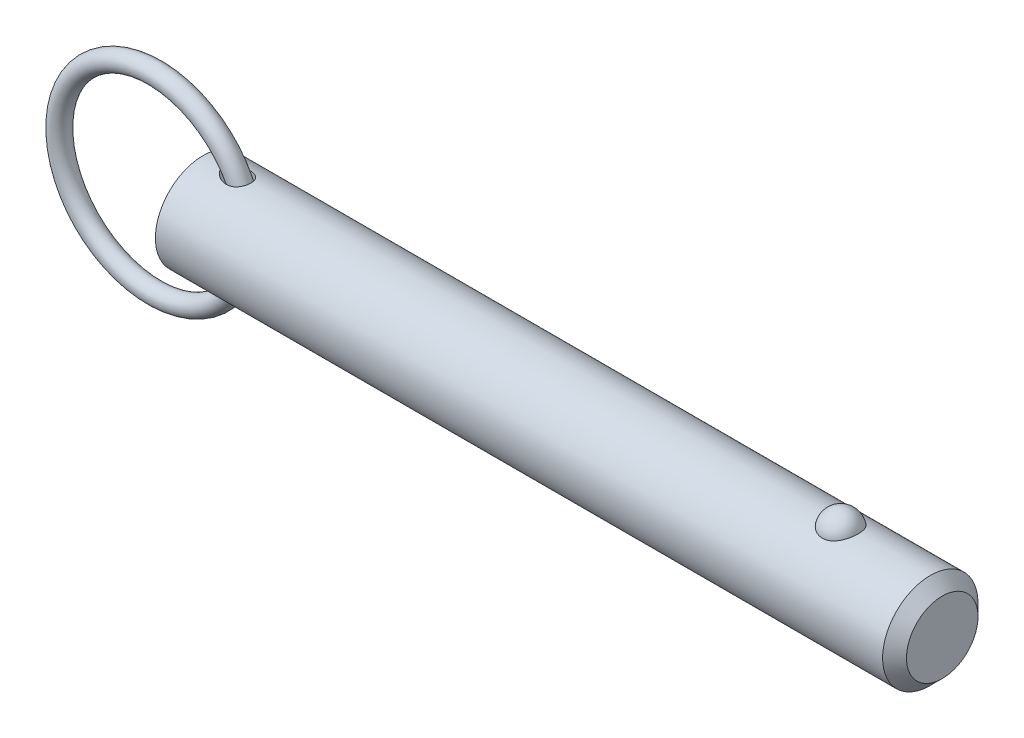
ISO-10303-21;
HEADER;
FILE_DESCRIPTION(('STEP AP214'),'2;1');
FILE_NAME('part.step','',(''),(''),'','','');
FILE_SCHEMA(('AUTOMOTIVE_DESIGN { 1 0 10303 214 1 1 1 1 }'));
ENDSEC;
DATA;
#1=APPLICATION_CONTEXT('core data for automotive mechanical design processes');
#2=APPLICATION_PROTOCOL_DEFINITION('international standard','automotive_design',2000,#1);
#3=PRODUCT_CONTEXT('',#1,'mechanical');
#4=PRODUCT('Part','Part','',(#3));
#5=PRODUCT_RELATED_PRODUCT_CATEGORY('part','',(#4));
#6=PRODUCT_DEFINITION_FORMATION('','',#4);
#7=PRODUCT_DEFINITION_CONTEXT('part definition',#1,'design');
#8=PRODUCT_DEFINITION('design','',#6,#7);
#9=PRODUCT_DEFINITION_SHAPE('','',#8);
#10=(LENGTH_UNIT() NAMED_UNIT(*) SI_UNIT(.MILLI.,.METRE.));
#11=(NAMED_UNIT(*) PLANE_ANGLE_UNIT() SI_UNIT($,.RADIAN.));
#12=(NAMED_UNIT(*) SI_UNIT($,.STERADIAN.) SOLID_ANGLE_UNIT());
#13=UNCERTAINTY_MEASURE_WITH_UNIT(LENGTH_MEASURE(1.E-05),#10,'distance_accuracy_value','');
#14=(GEOMETRIC_REPRESENTATION_CONTEXT(3) GLOBAL_UNCERTAINTY_ASSIGNED_CONTEXT((#13)) GLOBAL_UNIT_ASSIGNED_CONTEXT((#10,
#11,#12)) REPRESENTATION_CONTEXT('',''));
#15=CARTESIAN_POINT('',(0.,0.,0.));
#16=DIRECTION('',(0.,0.,1.));
#17=DIRECTION('',(1.,0.,0.));
#18=AXIS2_PLACEMENT_3D('',#15,#16,#17);
#19=CARTESIAN_POINT('',(-9.66825126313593,0.,0.));
#20=DIRECTION('',(0.,0.,1.));
#21=DIRECTION('',(1.,0.,0.));
#22=AXIS2_PLACEMENT_3D('',#19,#20,#21);
#23=TOROIDAL_SURFACE('',#22,19.05,1.905);
#24=CARTESIAN_POINT('',(11.2867487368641,0.,0.));
#25=VERTEX_POINT('',#24);
#26=VERTEX_LOOP('',#25);
#27=FACE_BOUND('',#26,.T.);
#28=ADVANCED_FACE('P0_F12',(#27),#23,.T.);
#29=CLOSED_SHELL('',(#28));
#30=MANIFOLD_SOLID_BREP('P0_B1',#29);
#31=CARTESIAN_POINT('',(0.,0.,0.));
#32=DIRECTION('',(1.,0.,0.));
#33=DIRECTION('',(0.,0.,-1.));
#34=AXIS2_PLACEMENT_3D('',#31,#32,#33);
#35=CYLINDRICAL_SURFACE('',#34,9.525);
#36=CARTESIAN_POINT('',(4.56693409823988,9.43141941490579,-1.33189820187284));
#37=CARTESIAN_POINT('',(4.70260475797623,9.41020313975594,-1.48215931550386));
#38=CARTESIAN_POINT('',(4.85555680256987,9.38755003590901,-1.61683982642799));
#39=CARTESIAN_POINT('',(5.10171959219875,9.35450554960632,-1.79512943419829));
#40=CARTESIAN_POINT('',(5.18674514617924,9.34362629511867,-1.85068909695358));
#41=CARTESIAN_POINT('',(5.36154389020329,9.32258514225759,-1.95392002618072));
#42=CARTESIAN_POINT('',(5.45131542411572,9.31242299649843,-2.00159402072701));
#43=CARTESIAN_POINT('',(5.70070211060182,9.28632120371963,-2.12033289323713));
#44=CARTESIAN_POINT('',(5.86420408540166,9.27146938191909,-2.18362944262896));
#45=CARTESIAN_POINT('',(6.19893345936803,9.24694163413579,-2.28525783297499));
#46=CARTESIAN_POINT('',(6.37015384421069,9.23726110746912,-2.32361187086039));
#47=CARTESIAN_POINT('',(6.73531776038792,9.22400982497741,-2.37575048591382));
#48=CARTESIAN_POINT('',(6.92975826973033,9.22118808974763,-2.38652934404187));
#49=CARTESIAN_POINT('',(7.21995443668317,9.22416297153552,-2.37494980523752));
#50=CARTESIAN_POINT('',(7.31643847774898,9.22635560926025,-2.366466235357));
#51=CARTESIAN_POINT('',(7.50796421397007,9.2331428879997,-2.33985028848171));
#52=CARTESIAN_POINT('',(7.60300650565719,9.23773650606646,-2.32172202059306));
#53=CARTESIAN_POINT('',(7.83273114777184,9.25183311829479,-2.26504721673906));
#54=CARTESIAN_POINT('',(7.96603028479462,9.26261470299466,-2.2209856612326));
#55=CARTESIAN_POINT('',(8.22310899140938,9.28816519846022,-2.11157306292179));
#56=CARTESIAN_POINT('',(8.34689477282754,9.30293147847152,-2.04623606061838));
#57=CARTESIAN_POINT('',(8.58136049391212,9.3349416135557,-1.89485344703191));
#58=CARTESIAN_POINT('',(8.69199721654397,9.35219324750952,-1.80874222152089));
#59=CARTESIAN_POINT('',(8.89592093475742,9.38707016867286,-1.61799188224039));
#60=CARTESIAN_POINT('',(8.98920771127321,9.40469546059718,-1.51335253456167));
#61=CARTESIAN_POINT('',(9.15057731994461,9.43713590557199,-1.29519427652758));
#62=CARTESIAN_POINT('',(9.21980158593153,9.45205440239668,-1.18253282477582));
#63=CARTESIAN_POINT('',(9.33826736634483,9.47856708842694,-0.946802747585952));
#64=CARTESIAN_POINT('',(9.38751161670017,9.49016173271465,-0.823735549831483));
#65=CARTESIAN_POINT('',(9.46423850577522,9.50859378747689,-0.572614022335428));
#66=CARTESIAN_POINT('',(9.49202393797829,9.5154972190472,-0.444656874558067));
#67=CARTESIAN_POINT('',(9.52636926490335,9.52406905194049,-0.185752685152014));
#68=CARTESIAN_POINT('',(9.53292923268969,9.52573747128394,-0.0548056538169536));
#69=CARTESIAN_POINT('',(9.52467276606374,9.52365852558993,0.206503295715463));
#70=CARTESIAN_POINT('',(9.50983454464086,9.51990564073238,0.336864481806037));
#71=CARTESIAN_POINT('',(9.45907362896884,9.50737852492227,0.59316631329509));
#72=CARTESIAN_POINT('',(9.42315106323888,9.49860432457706,0.71910698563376));
#73=CARTESIAN_POINT('',(9.33106648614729,9.47698928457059,0.96295935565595));
#74=CARTESIAN_POINT('',(9.27490839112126,9.46414923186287,1.08087260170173));
#75=CARTESIAN_POINT('',(9.14375803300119,9.43581000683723,1.30534632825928));
#76=CARTESIAN_POINT('',(9.06876720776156,9.42031103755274,1.41190767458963));
#77=CARTESIAN_POINT('',(8.90203187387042,9.38836719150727,1.61069439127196));
#78=CARTESIAN_POINT('',(8.81029913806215,9.37192298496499,1.70292975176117));
#79=CARTESIAN_POINT('',(8.61268775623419,9.33985045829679,1.87086859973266));
#80=CARTESIAN_POINT('',(8.50680947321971,9.3242221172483,1.94657251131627));
#81=CARTESIAN_POINT('',(8.28220546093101,9.29513431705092,2.08109032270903));
#82=CARTESIAN_POINT('',(8.16329919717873,9.28171415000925,2.1396103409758));
#83=CARTESIAN_POINT('',(7.91756052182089,9.25859072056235,2.23755716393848));
#84=CARTESIAN_POINT('',(7.79072606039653,9.24888842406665,2.27697900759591));
#85=CARTESIAN_POINT('',(7.52377913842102,9.23338749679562,2.33907806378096));
#86=CARTESIAN_POINT('',(7.38334767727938,9.22789571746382,2.36044900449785));
#87=CARTESIAN_POINT('',(7.10081394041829,9.22210229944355,2.3829751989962));
#88=CARTESIAN_POINT('',(6.95871103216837,9.22180269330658,2.38412253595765));
#89=CARTESIAN_POINT('',(6.65642691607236,9.22632724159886,2.36656230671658));
#90=CARTESIAN_POINT('',(6.49641694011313,9.23185415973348,2.3451317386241));
#91=CARTESIAN_POINT('',(6.18115433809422,9.24811737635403,2.28014143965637));
#92=CARTESIAN_POINT('',(6.02590710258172,9.25885936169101,2.23655754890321));
#93=CARTESIAN_POINT('',(5.6990472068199,9.28624254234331,2.12025087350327));
#94=CARTESIAN_POINT('',(5.52873601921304,9.30354853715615,2.04400672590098));
#95=CARTESIAN_POINT('',(5.20289495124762,9.34106989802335,1.86504730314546));
#96=CARTESIAN_POINT('',(5.04735968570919,9.36128419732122,1.76234172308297));
#97=CARTESIAN_POINT('',(4.79287124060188,9.39697639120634,1.55895334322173));
#98=CARTESIAN_POINT('',(4.68938704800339,9.41240250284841,1.46392900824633));
#99=CARTESIAN_POINT('',(4.49847141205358,9.44202586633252,1.25875918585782));
#100=CARTESIAN_POINT('',(4.41101129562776,9.45622528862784,1.1486413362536));
#101=CARTESIAN_POINT('',(4.27502257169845,9.47888210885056,0.940600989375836));
#102=CARTESIAN_POINT('',(4.22216329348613,9.48791121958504,0.845586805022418));
#103=CARTESIAN_POINT('',(4.13241478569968,9.50344321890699,0.648051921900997));
#104=CARTESIAN_POINT('',(4.09551182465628,9.50994827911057,0.545537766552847));
#105=CARTESIAN_POINT('',(4.04043124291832,9.51971586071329,0.334452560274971));
#106=CARTESIAN_POINT('',(4.02240728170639,9.52295176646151,0.225839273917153));
#107=CARTESIAN_POINT('',(4.00750873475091,9.52562364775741,0.00713006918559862));
#108=CARTESIAN_POINT('',(4.01062334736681,9.52506156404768,-0.10296506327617));
#109=CARTESIAN_POINT('',(4.03592967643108,9.52053221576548,-0.306944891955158));
#110=CARTESIAN_POINT('',(4.05571676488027,9.51699426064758,-0.401151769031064));
#111=CARTESIAN_POINT('',(4.10967975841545,9.5074546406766,-0.585176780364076));
#112=CARTESIAN_POINT('',(4.14385995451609,9.50145224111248,-0.674993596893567));
#113=CARTESIAN_POINT('',(4.23261356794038,9.48611703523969,-0.866116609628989));
#114=CARTESIAN_POINT('',(4.28990016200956,9.47635800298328,-0.96612166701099));
#115=CARTESIAN_POINT('',(4.41856577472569,9.45502867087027,-1.15640011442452));
#116=CARTESIAN_POINT('',(4.48996918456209,9.44345524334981,-1.24665623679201));
#117=CARTESIAN_POINT('',(4.56693409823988,9.43141941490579,-1.33189820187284));
#118=B_SPLINE_CURVE_WITH_KNOTS('',3,(#36,#37,#38,#39,#40,#41,#42,#43,#44,#45,#46,#47,#48,#49,
#50,#51,#52,#53,#54,#55,#56,#57,#58,#59,#60,#61,#62,#63,#64,#65,#66,#67,#68,#69,#70,#71,#72,#73,
#74,#75,#76,#77,#78,#79,#80,#81,#82,#83,#84,#85,#86,#87,#88,#89,#90,#91,#92,#93,#94,#95,#96,#97,
#98,#99,#100,#101,#102,#103,#104,#105,#106,#107,#108,#109,#110,#111,#112,#113,#114,#115,#116,
#117),.UNSPECIFIED.,.T.,.F.,(4,2,2,2,2,2,2,2,2,2,2,2,2,2,2,2,2,2,2,2,2,2,2,2,2,2,2,2,2,2,2,2,2,
2,2,2,2,2,2,2,4),(0.,0.609951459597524,0.916123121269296,1.22218863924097,1.74791337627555,
2.27316961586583,2.85362722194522,3.14383229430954,3.43391382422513,3.85437497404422,
4.27455920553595,4.69608835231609,5.11762282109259,5.5149005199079,5.91212379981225,
6.30363414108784,6.69514313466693,7.08705103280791,7.47895654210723,7.87078624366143,
8.26258603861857,8.65411137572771,9.04562666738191,9.44349251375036,9.84146165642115,
10.2662286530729,10.6911619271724,11.1739180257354,11.6572017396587,12.2170157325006,
12.776624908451,13.1992556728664,13.6211226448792,13.9471990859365,14.2729943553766,
14.6014211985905,14.9296802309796,15.2173810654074,15.505167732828,15.8505863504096,
16.1966070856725),.UNSPECIFIED.);
#119=CARTESIAN_POINT('',(4.56693409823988,9.43141941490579,-1.33189820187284));
#120=VERTEX_POINT('',#119);
#121=EDGE_CURVE('P1_E40',#120,#120,#118,.T.);
#122=ORIENTED_EDGE('',*,*,#121,.T.);
#123=EDGE_LOOP('',(#122));
#124=FACE_BOUND('',#123,.T.);
#125=CARTESIAN_POINT('',(145.24875,0.,0.));
#126=DIRECTION('',(1.,0.,0.));
#127=DIRECTION('',(0.,0.,-1.));
#128=AXIS2_PLACEMENT_3D('',#125,#126,#127);
#129=CIRCLE('',#128,9.525);
#130=CARTESIAN_POINT('',(145.24875,0.,-9.525));
#131=VERTEX_POINT('',#130);
#132=EDGE_CURVE('P1_E25',#131,#131,#129,.T.);
#133=ORIENTED_EDGE('',*,*,#132,.F.);
#134=EDGE_LOOP('',(#133));
#135=FACE_BOUND('',#134,.T.);
#136=CARTESIAN_POINT('',(0.,0.,0.));
#137=DIRECTION('',(1.,0.,0.));
#138=DIRECTION('',(0.,0.,-1.));
#139=AXIS2_PLACEMENT_3D('',#136,#137,#138);
#140=CIRCLE('',#139,9.525);
#141=CARTESIAN_POINT('',(0.,0.,-9.525));
#142=VERTEX_POINT('',#141);
#143=EDGE_CURVE('P1_E9',#142,#142,#140,.T.);
#144=ORIENTED_EDGE('',*,*,#143,.T.);
#145=EDGE_LOOP('',(#144));
#146=FACE_BOUND('',#145,.T.);
#147=CARTESIAN_POINT('',(127.345757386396,8.80405803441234,3.63513233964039));
#148=CARTESIAN_POINT('',(127.251676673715,8.80405953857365,3.63513053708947));
#149=CARTESIAN_POINT('',(127.157561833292,8.80561325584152,3.63137461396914));
#150=CARTESIAN_POINT('',(126.970012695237,8.81177748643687,3.61638665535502));
#151=CARTESIAN_POINT('',(126.876578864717,8.81638992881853,3.60514990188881));
#152=CARTESIAN_POINT('',(126.597945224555,8.83467114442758,3.56024627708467));
#153=CARTESIAN_POINT('',(126.414691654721,8.85278327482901,3.51538626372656));
#154=CARTESIAN_POINT('',(126.059509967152,8.89871214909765,3.39742145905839));
#155=CARTESIAN_POINT('',(125.887553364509,8.92650327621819,3.32439116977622));
#156=CARTESIAN_POINT('',(125.558707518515,8.98874819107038,3.15220244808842));
#157=CARTESIAN_POINT('',(125.401811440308,9.02319893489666,3.053055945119));
#158=CARTESIAN_POINT('',(125.102214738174,9.0962918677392,2.82797815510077));
#159=CARTESIAN_POINT('',(124.960060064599,9.13502685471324,2.70135138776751));
#160=CARTESIAN_POINT('',(124.698299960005,9.21186572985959,2.42641932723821));
#161=CARTESIAN_POINT('',(124.578701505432,9.2499694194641,2.27810735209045));
#162=CARTESIAN_POINT('',(124.359645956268,9.3234108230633,1.95652290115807));
#163=CARTESIAN_POINT('',(124.261317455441,9.35855090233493,1.78243511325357));
#164=CARTESIAN_POINT('',(124.093819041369,9.42045142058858,1.41937246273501));
#165=CARTESIAN_POINT('',(124.024651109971,9.44721128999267,1.23039658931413));
#166=CARTESIAN_POINT('',(123.916199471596,9.48990641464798,0.840370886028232));
#167=CARTESIAN_POINT('',(123.877288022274,9.50570658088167,0.639202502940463));
#168=CARTESIAN_POINT('',(123.831555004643,9.52433146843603,0.232664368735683));
#169=CARTESIAN_POINT('',(123.824732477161,9.52715657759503,0.0272947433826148));
#170=CARTESIAN_POINT('',(123.843255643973,9.51956918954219,-0.380478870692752));
#171=CARTESIAN_POINT('',(123.868405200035,9.50923740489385,-0.582893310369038));
#172=CARTESIAN_POINT('',(123.95002537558,9.47651897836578,-0.980293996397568));
#173=CARTESIAN_POINT('',(124.006496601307,9.45413210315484,-1.17528009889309));
#174=CARTESIAN_POINT('',(124.149719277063,9.39954044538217,-1.55263697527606));
#175=CARTESIAN_POINT('',(124.236512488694,9.36732213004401,-1.73498993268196));
#176=CARTESIAN_POINT('',(124.438610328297,9.29640700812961,-2.08177763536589));
#177=CARTESIAN_POINT('',(124.553917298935,9.25770966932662,-2.24621090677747));
#178=CARTESIAN_POINT('',(124.811264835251,9.17775604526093,-2.55338333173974));
#179=CARTESIAN_POINT('',(124.953434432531,9.13648808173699,-2.69601150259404));
#180=CARTESIAN_POINT('',(125.26089985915,9.05620497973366,-2.95451229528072));
#181=CARTESIAN_POINT('',(125.426193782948,9.01718965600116,-3.07038711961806));
#182=CARTESIAN_POINT('',(125.772052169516,8.94680019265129,-3.26976836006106));
#183=CARTESIAN_POINT('',(125.952227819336,8.91528408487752,-3.35389750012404));
#184=CARTESIAN_POINT('',(126.325651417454,8.86272514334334,-3.49043503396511));
#185=CARTESIAN_POINT('',(126.518894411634,8.84167836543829,-3.54285537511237));
#186=CARTESIAN_POINT('',(126.902503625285,8.81348056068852,-3.612413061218));
#187=CARTESIAN_POINT('',(127.092525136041,8.80568348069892,-3.63119339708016));
#188=CARTESIAN_POINT('',(127.473190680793,8.80289410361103,-3.63795342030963));
#189=CARTESIAN_POINT('',(127.663834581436,8.80789922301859,-3.62593932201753));
#190=CARTESIAN_POINT('',(128.034007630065,8.82974915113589,-3.57238430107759));
#191=CARTESIAN_POINT('',(128.213697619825,8.84621463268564,-3.53178890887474));
#192=CARTESIAN_POINT('',(128.563422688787,8.88875330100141,-3.42331083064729));
#193=CARTESIAN_POINT('',(128.733456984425,8.91482726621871,-3.35542593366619));
#194=CARTESIAN_POINT('',(129.063237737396,8.974482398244,-3.1924822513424));
#195=CARTESIAN_POINT('',(129.222680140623,9.00821446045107,-3.09686474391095));
#196=CARTESIAN_POINT('',(129.523513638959,9.0793539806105,-2.88162736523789));
#197=CARTESIAN_POINT('',(129.664900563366,9.1167622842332,-2.76200196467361));
#198=CARTESIAN_POINT('',(129.93331931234,9.19347419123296,-2.4951628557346));
#199=CARTESIAN_POINT('',(130.059275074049,9.23277872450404,-2.34686614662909));
#200=CARTESIAN_POINT('',(130.285522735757,9.30737610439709,-2.03093683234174));
#201=CARTESIAN_POINT('',(130.38581004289,9.34266823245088,-1.86330077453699));
#202=CARTESIAN_POINT('',(130.561514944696,9.40674710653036,-1.50744893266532));
#203=CARTESIAN_POINT('',(130.636041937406,9.4352917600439,-1.31874876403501));
#204=CARTESIAN_POINT('',(130.75416505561,9.48144132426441,-0.93063102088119));
#205=CARTESIAN_POINT('',(130.797760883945,9.49904612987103,-0.731213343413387));
#206=CARTESIAN_POINT('',(130.853158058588,9.5215314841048,-0.327147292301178));
#207=CARTESIAN_POINT('',(130.864935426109,9.52640243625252,-0.122495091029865));
#208=CARTESIAN_POINT('',(130.856382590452,9.52289571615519,0.286018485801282));
#209=CARTESIAN_POINT('',(130.83605305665,9.51451832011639,0.489879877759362));
#210=CARTESIAN_POINT('',(130.763884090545,9.48544083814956,0.889994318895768));
#211=CARTESIAN_POINT('',(130.712199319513,9.46480124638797,1.08627971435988));
#212=CARTESIAN_POINT('',(130.578491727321,9.41333895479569,1.4668208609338));
#213=CARTESIAN_POINT('',(130.496466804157,9.38251554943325,1.6510757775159));
#214=CARTESIAN_POINT('',(130.30319292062,9.31365636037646,2.00346348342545));
#215=CARTESIAN_POINT('',(130.191783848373,9.27558138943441,2.17150083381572));
#216=CARTESIAN_POINT('',(129.942294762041,9.19638714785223,2.48563115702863));
#217=CARTESIAN_POINT('',(129.804216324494,9.1552680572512,2.63172542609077));
#218=CARTESIAN_POINT('',(129.504843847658,9.07465393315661,2.89750997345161));
#219=CARTESIAN_POINT('',(129.343610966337,9.03515496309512,3.01726776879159));
#220=CARTESIAN_POINT('',(129.001613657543,8.96227564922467,3.22732920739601));
#221=CARTESIAN_POINT('',(128.820841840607,8.92889763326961,3.3176216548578));
#222=CARTESIAN_POINT('',(128.451445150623,8.87345380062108,3.4631441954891));
#223=CARTESIAN_POINT('',(128.26332371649,8.8510298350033,3.51950082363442));
#224=CARTESIAN_POINT('',(127.97578699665,8.82666967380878,3.57993683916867));
#225=CARTESIAN_POINT('',(127.879133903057,8.82009725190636,3.59606217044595));
#226=CARTESIAN_POINT('',(127.684677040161,8.81020897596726,3.62022512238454));
#227=CARTESIAN_POINT('',(127.58687410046,8.80689090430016,3.62826825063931));
#228=CARTESIAN_POINT('',(127.441224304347,8.80445615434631,3.63416760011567));
#229=CARTESIAN_POINT('',(127.393495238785,8.80405727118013,3.63513325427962));
#230=CARTESIAN_POINT('',(127.345757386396,8.80405803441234,3.63513233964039));
#231=B_SPLINE_CURVE_WITH_KNOTS('',3,(#147,#148,#149,#150,#151,#152,#153,#154,#155,#156,#157,
#158,#159,#160,#161,#162,#163,#164,#165,#166,#167,#168,#169,#170,#171,#172,#173,#174,#175,#176,
#177,#178,#179,#180,#181,#182,#183,#184,#185,#186,#187,#188,#189,#190,#191,#192,#193,#194,#195,
#196,#197,#198,#199,#200,#201,#202,#203,#204,#205,#206,#207,#208,#209,#210,#211,#212,#213,#214,
#215,#216,#217,#218,#219,#220,#221,#222,#223,#224,#225,#226,#227,#228,#229,#230),.UNSPECIFIED.,
.T.,.F.,(4,2,2,2,2,2,2,2,2,2,2,2,2,2,2,2,2,2,2,2,2,2,2,2,2,2,2,2,2,2,2,2,2,2,2,2,2,2,2,2,2,4),
(0.,0.282202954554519,0.564584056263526,1.13017050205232,1.69427128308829,2.25811483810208,
2.83836627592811,3.41879688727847,4.0249711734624,4.63118665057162,5.24474754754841,
5.85829010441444,6.46808687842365,7.0778954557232,7.68854723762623,8.29924920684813,
8.91296283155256,9.52662591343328,10.127533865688,10.7282152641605,11.2986646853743,
11.8689989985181,12.4213015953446,12.9736489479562,13.5380053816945,14.102491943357,
14.6952986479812,15.288211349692,15.8999469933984,16.5116885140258,17.1238909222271,
17.7360805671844,18.3452748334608,18.954511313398,19.5671386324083,20.1797297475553,
20.7907316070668,21.4019653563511,21.9915938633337,22.2859053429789,22.5800161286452,
22.7232098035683),.UNSPECIFIED.);
#232=CARTESIAN_POINT('',(127.345757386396,8.80405803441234,3.63513233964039));
#233=VERTEX_POINT('',#232);
#234=EDGE_CURVE('P1_E34',#233,#233,#231,.T.);
#235=ORIENTED_EDGE('',*,*,#234,.T.);
#236=EDGE_LOOP('',(#235));
#237=FACE_BOUND('',#236,.T.);
#238=CARTESIAN_POINT('',(4.56693409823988,-9.43141941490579,-1.33189820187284));
#239=CARTESIAN_POINT('',(4.48932984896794,-9.4435553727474,-1.24594548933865));
#240=CARTESIAN_POINT('',(4.41737309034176,-9.45522193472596,-1.1548795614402));
#241=CARTESIAN_POINT('',(4.2878104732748,-9.47670896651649,-0.962782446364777));
#242=CARTESIAN_POINT('',(4.23019403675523,-9.48653079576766,-0.861758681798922));
#243=CARTESIAN_POINT('',(4.13254559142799,-9.5034118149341,-0.649723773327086));
#244=CARTESIAN_POINT('',(4.09271158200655,-9.51043980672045,-0.538615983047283));
#245=CARTESIAN_POINT('',(4.04973167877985,-9.51806966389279,-0.367764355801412));
#246=CARTESIAN_POINT('',(4.03820037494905,-9.52012756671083,-0.310118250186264));
#247=CARTESIAN_POINT('',(4.02100287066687,-9.52320274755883,-0.193935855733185));
#248=CARTESIAN_POINT('',(4.01533565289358,-9.52422020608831,-0.13539972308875));
#249=CARTESIAN_POINT('',(4.00817074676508,-9.52550497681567,0.0247266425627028));
#250=CARTESIAN_POINT('',(4.01270492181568,-9.52468821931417,0.126661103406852));
#251=CARTESIAN_POINT('',(4.0395497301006,-9.51988506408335,0.328012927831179));
#252=CARTESIAN_POINT('',(4.0618645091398,-9.51589792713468,0.427429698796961));
#253=CARTESIAN_POINT('',(4.12088980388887,-9.5054852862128,0.61636200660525));
#254=CARTESIAN_POINT('',(4.15684838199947,-9.49918763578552,0.706123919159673));
#255=CARTESIAN_POINT('',(4.24094647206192,-9.48470618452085,0.879522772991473));
#256=CARTESIAN_POINT('',(4.28909090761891,-9.47652162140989,0.96315722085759));
#257=CARTESIAN_POINT('',(4.42295891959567,-9.45426317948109,1.16513741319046));
#258=CARTESIAN_POINT('',(4.51523752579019,-9.43933320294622,1.27905352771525));
#259=CARTESIAN_POINT('',(4.71682295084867,-9.40825940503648,1.49055892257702));
#260=CARTESIAN_POINT('',(4.8261728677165,-9.39211256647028,1.58810554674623));
#261=CARTESIAN_POINT('',(5.09064226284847,-9.35555264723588,1.79246125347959));
#262=CARTESIAN_POINT('',(5.24990411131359,-9.33524115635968,1.89393122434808));
#263=CARTESIAN_POINT('',(5.58309255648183,-9.29785396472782,2.06968659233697));
#264=CARTESIAN_POINT('',(5.75702897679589,-9.28078045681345,2.14395359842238));
#265=CARTESIAN_POINT('',(6.11646882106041,-9.25213303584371,2.26440412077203));
#266=CARTESIAN_POINT('',(6.3020558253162,-9.2406056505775,2.31035092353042));
#267=CARTESIAN_POINT('',(6.67856093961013,-9.22541807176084,2.37029728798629));
#268=CARTESIAN_POINT('',(6.86947045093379,-9.2217458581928,2.3843456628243));
#269=CARTESIAN_POINT('',(7.21217144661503,-9.22344239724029,2.37775005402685));
#270=CARTESIAN_POINT('',(7.36409439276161,-9.22713860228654,2.36352577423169));
#271=CARTESIAN_POINT('',(7.66346227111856,-9.24048072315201,2.31082299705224));
#272=CARTESIAN_POINT('',(7.81090958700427,-9.25012341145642,2.27235765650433));
#273=CARTESIAN_POINT('',(8.09730316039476,-9.2746609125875,2.17003648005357));
#274=CARTESIAN_POINT('',(8.23619652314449,-9.28958517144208,2.10603803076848));
#275=CARTESIAN_POINT('',(8.49918675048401,-9.32290326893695,1.9532444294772));
#276=CARTESIAN_POINT('',(8.62328895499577,-9.34129584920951,1.86445826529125));
#277=CARTESIAN_POINT('',(8.84006515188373,-9.37706953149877,1.67466761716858));
#278=CARTESIAN_POINT('',(8.93465172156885,-9.39436331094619,1.57582357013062));
#279=CARTESIAN_POINT('',(9.1049023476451,-9.42761680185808,1.362809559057));
#280=CARTESIAN_POINT('',(9.18057146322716,-9.44357686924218,1.24864370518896));
#281=CARTESIAN_POINT('',(9.30789178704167,-9.47159985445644,1.01379272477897));
#282=CARTESIAN_POINT('',(9.3604554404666,-9.48380365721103,0.893617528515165));
#283=CARTESIAN_POINT('',(9.44498362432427,-9.50388751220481,0.645890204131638));
#284=CARTESIAN_POINT('',(9.47694947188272,-9.51176784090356,0.518338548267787));
#285=CARTESIAN_POINT('',(9.51944262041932,-9.52232073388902,0.260103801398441));
#286=CARTESIAN_POINT('',(9.53006646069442,-9.52501674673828,0.129437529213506));
#287=CARTESIAN_POINT('',(9.52993291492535,-9.52498309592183,-0.131885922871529));
#288=CARTESIAN_POINT('',(9.51917525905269,-9.52225336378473,-0.262543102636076));
#289=CARTESIAN_POINT('',(9.47648788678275,-9.51165418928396,-0.520312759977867));
#290=CARTESIAN_POINT('',(9.44453086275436,-9.50377811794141,-0.647420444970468));
#291=CARTESIAN_POINT('',(9.36015568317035,-9.48373425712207,-0.894290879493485));
#292=CARTESIAN_POINT('',(9.30773827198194,-9.47156662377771,-1.01405389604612));
#293=CARTESIAN_POINT('',(9.18380895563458,-9.44428888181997,-1.24269386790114));
#294=CARTESIAN_POINT('',(9.11232064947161,-9.42918241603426,-1.3515840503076));
#295=CARTESIAN_POINT('',(8.95212687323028,-9.39767706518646,-1.55562459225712));
#296=CARTESIAN_POINT('',(8.86342281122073,-9.3812782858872,-1.65077607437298));
#297=CARTESIAN_POINT('',(8.67104443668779,-9.34891827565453,-1.82517515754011));
#298=CARTESIAN_POINT('',(8.56732858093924,-9.33295841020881,-1.90437711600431));
#299=CARTESIAN_POINT('',(8.34818438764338,-9.30317889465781,-2.0449122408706));
#300=CARTESIAN_POINT('',(8.23275529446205,-9.2893593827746,-2.10624425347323));
#301=CARTESIAN_POINT('',(7.98961240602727,-9.26475003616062,-2.2120340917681));
#302=CARTESIAN_POINT('',(7.86162088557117,-9.25407358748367,-2.25587700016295));
#303=CARTESIAN_POINT('',(7.60027499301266,-9.23720810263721,-2.32397032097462));
#304=CARTESIAN_POINT('',(7.46691858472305,-9.23102078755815,-2.34821321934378));
#305=CARTESIAN_POINT('',(7.18516230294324,-9.22302718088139,-2.37943079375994));
#306=CARTESIAN_POINT('',(7.0365445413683,-9.22169704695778,-2.38452997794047));
#307=CARTESIAN_POINT('',(6.74015049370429,-9.22442327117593,-2.37395141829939));
#308=CARTESIAN_POINT('',(6.59237455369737,-9.22848170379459,-2.35826567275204));
#309=CARTESIAN_POINT('',(6.27762777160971,-9.2422287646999,-2.30385559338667));
#310=CARTESIAN_POINT('',(6.11124715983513,-9.25269504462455,-2.26192683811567));
#311=CARTESIAN_POINT('',(5.78635920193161,-9.27830776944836,-2.15445569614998));
#312=CARTESIAN_POINT('',(5.62786567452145,-9.29346211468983,-2.08887341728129));
#313=CARTESIAN_POINT('',(5.3901306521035,-9.31931237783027,-1.96924953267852));
#314=CARTESIAN_POINT('',(5.30683088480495,-9.32901725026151,-1.92292485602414));
#315=CARTESIAN_POINT('',(5.14455801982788,-9.34899035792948,-1.82334419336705));
#316=CARTESIAN_POINT('',(5.06558607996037,-9.35925874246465,-1.77008636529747));
#317=CARTESIAN_POINT('',(4.83670950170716,-9.39034445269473,-1.60010986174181));
#318=CARTESIAN_POINT('',(4.69422471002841,-9.41151337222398,-1.47288240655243));
#319=CARTESIAN_POINT('',(4.56693409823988,-9.43141941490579,-1.33189820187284));
#320=B_SPLINE_CURVE_WITH_KNOTS('',3,(#238,#239,#240,#241,#242,#243,#244,#245,#246,#247,#248,
#249,#250,#251,#252,#253,#254,#255,#256,#257,#258,#259,#260,#261,#262,#263,#264,#265,#266,#267,
#268,#269,#270,#271,#272,#273,#274,#275,#276,#277,#278,#279,#280,#281,#282,#283,#284,#285,#286,
#287,#288,#289,#290,#291,#292,#293,#294,#295,#296,#297,#298,#299,#300,#301,#302,#303,#304,#305,
#306,#307,#308,#309,#310,#311,#312,#313,#314,#315,#316,#317,#318,#319),.UNSPECIFIED.,.T.,.F.,(4,
2,2,2,2,2,2,2,2,2,2,2,2,2,2,2,2,2,2,2,2,2,2,2,2,2,2,2,2,2,2,2,2,2,2,2,2,2,2,2,4),(0.,
0.348900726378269,0.697543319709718,1.0499765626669,1.22617690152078,1.40234666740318,
1.70666745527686,2.01105922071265,2.30066493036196,2.59038784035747,3.03001384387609,
3.4707682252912,4.03766594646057,4.60494622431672,5.17690598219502,5.74798989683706,
6.2040084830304,6.65977977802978,7.11813321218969,7.57632066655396,7.98791759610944,
8.39940433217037,8.79273459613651,9.18603970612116,9.577561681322,9.96908859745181,
10.3611208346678,10.7531388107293,11.1446739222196,11.536177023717,11.9287850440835,
12.3214184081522,12.7268448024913,13.1324265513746,13.5768390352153,14.0214226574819,
14.5351685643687,15.0497849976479,15.3368801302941,15.6240516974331,16.1963372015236),.UNSPECIFIED.);
#321=CARTESIAN_POINT('',(4.56693409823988,-9.43141941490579,-1.33189820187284));
#322=VERTEX_POINT('',#321);
#323=EDGE_CURVE('P1_E17',#322,#322,#320,.T.);
#324=ORIENTED_EDGE('',*,*,#323,.T.);
#325=EDGE_LOOP('',(#324));
#326=FACE_BOUND('',#325,.T.);
#327=ADVANCED_FACE('P1_F13',(#124,#135,#146,#237,#326),#35,.T.);
#328=CARTESIAN_POINT('',(0.,0.,0.));
#329=DIRECTION('',(-1.,0.,0.));
#330=DIRECTION('',(0.,0.,1.));
#331=AXIS2_PLACEMENT_3D('',#328,#329,#330);
#332=PLANE('',#331);
#333=ORIENTED_EDGE('',*,*,#143,.F.);
#334=EDGE_LOOP('',(#333));
#335=FACE_BOUND('',#334,.T.);
#336=ADVANCED_FACE('P1_F15',(#335),#332,.T.);
#337=CARTESIAN_POINT('',(147.63,0.,0.));
#338=DIRECTION('',(-1.,0.,0.));
#339=DIRECTION('',(0.,0.,1.));
#340=AXIS2_PLACEMENT_3D('',#337,#338,#339);
#341=CONICAL_SURFACE('',#340,7.14375000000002,0.78539816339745);
#342=ORIENTED_EDGE('',*,*,#132,.T.);
#343=EDGE_LOOP('',(#342));
#344=FACE_BOUND('',#343,.T.);
#345=CARTESIAN_POINT('',(147.63,0.,0.));
#346=DIRECTION('',(1.,0.,0.));
#347=DIRECTION('',(0.,0.,-1.));
#348=AXIS2_PLACEMENT_3D('',#345,#346,#347);
#349=CIRCLE('',#348,7.14375000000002);
#350=CARTESIAN_POINT('',(147.63,0.,-7.14375000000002));
#351=VERTEX_POINT('',#350);
#352=EDGE_CURVE('P1_E30',#351,#351,#349,.T.);
#353=ORIENTED_EDGE('',*,*,#352,.F.);
#354=EDGE_LOOP('',(#353));
#355=FACE_BOUND('',#354,.T.);
#356=ADVANCED_FACE('P1_F55',(#344,#355),#341,.T.);
#357=CARTESIAN_POINT('',(147.63,7.14375000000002,0.));
#358=DIRECTION('',(1.,0.,0.));
#359=DIRECTION('',(0.,0.,-1.));
#360=AXIS2_PLACEMENT_3D('',#357,#358,#359);
#361=PLANE('',#360);
#362=ORIENTED_EDGE('',*,*,#352,.T.);
#363=EDGE_LOOP('',(#362));
#364=FACE_BOUND('',#363,.T.);
#365=ADVANCED_FACE('P1_F51',(#364),#361,.T.);
#366=CARTESIAN_POINT('',(127.345757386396,8.5725,0.));
#367=DIRECTION('',(-1.,0.,0.));
#368=DIRECTION('',(0.,-1.,0.));
#369=AXIS2_PLACEMENT_3D('',#366,#367,#368);
#370=SPHERICAL_SURFACE('',#369,3.64250000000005);
#371=ORIENTED_EDGE('',*,*,#234,.F.);
#372=EDGE_LOOP('',(#371));
#373=FACE_BOUND('',#372,.T.);
#374=ADVANCED_FACE('P1_F46',(#373),#370,.T.);
#375=CARTESIAN_POINT('',(-9.66825126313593,0.,0.));
#376=DIRECTION('',(0.,0.,1.));
#377=DIRECTION('',(1.,0.,0.));
#378=AXIS2_PLACEMENT_3D('',#375,#376,#377);
#379=TOROIDAL_SURFACE('',#378,19.05,2.38125);
#380=ORIENTED_EDGE('',*,*,#323,.F.);
#381=EDGE_LOOP('',(#380));
#382=FACE_BOUND('',#381,.T.);
#383=ORIENTED_EDGE('',*,*,#121,.F.);
#384=EDGE_LOOP('',(#383));
#385=FACE_BOUND('',#384,.T.);
#386=ADVANCED_FACE('P1_F50',(#382,#385),#379,.F.);
#387=CLOSED_SHELL('',(#327,#336,#356,#365,#374,#386));
#388=MANIFOLD_SOLID_BREP('P1_B1',#387);
#389=ADVANCED_BREP_SHAPE_REPRESENTATION('',(#18,#30,#388),#14);
#390=SHAPE_DEFINITION_REPRESENTATION(#9,#389);
ENDSEC;
END-ISO-10303-21;
